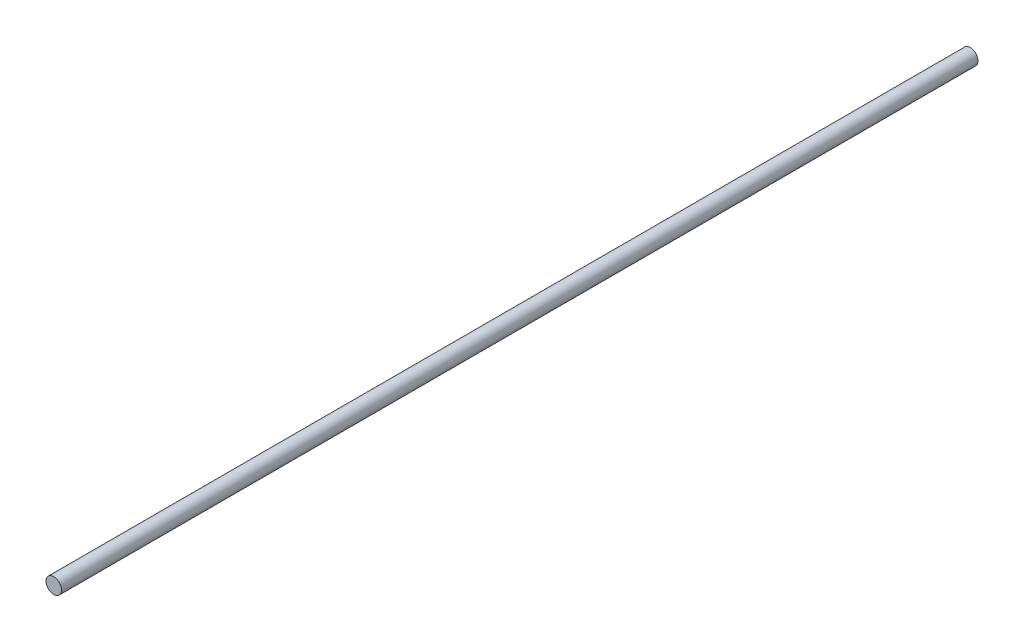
from build123d import *

# Parameters (mm, degrees)
SKETCH1_R           = 30
BOSS_EXTRUDE1_DEPTH = 3550


with BuildPart() as part:
    # Sketch1 → Boss-Extrude1 (new body)
    with BuildSketch(Plane.XY):
        Circle(SKETCH1_R)
    extrude(amount=-BOSS_EXTRUDE1_DEPTH)


solid = part.part
